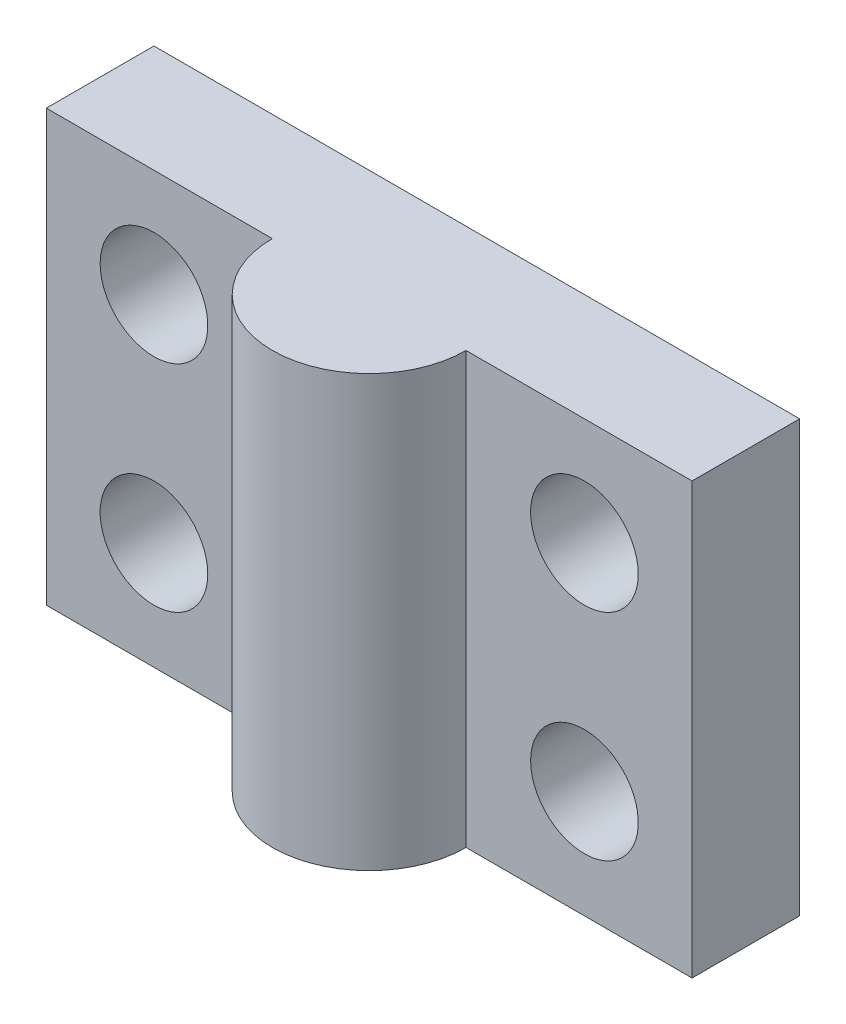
from build123d import *

# Parameters (mm, degrees)
SKETCH1_W           = 30
SKETCH1_H           = 20
SKETCH1_R           = 2.5
BOSS_EXTRUDE1_DEPTH = 5
BOSS_EXTRUDE2_DEPTH = 20


with BuildPart() as part:
    # Sketch1 → Boss-Extrude1 (new body)
    with BuildSketch(Plane.XY):
        Rectangle(SKETCH1_W, SKETCH1_H)
        with Locations((10, 5)):
            Circle(SKETCH1_R, mode=Mode.SUBTRACT)
        with Locations(Location((10, -5, 0), (0, 0, 180))):
            Circle(SKETCH1_R, mode=Mode.SUBTRACT)
        with Locations((-10, -5)):
            Circle(SKETCH1_R, mode=Mode.SUBTRACT)
        with Locations(Location((-10, 5, 0), (0, 0, 180))):
            Circle(SKETCH1_R, mode=Mode.SUBTRACT)
    extrude(amount=BOSS_EXTRUDE1_DEPTH)

    # Sketch2 → Boss-Extrude2 (add)
    with BuildSketch(Plane(origin=(0, 10, 0), x_dir=(1, 0, 0), z_dir=(0, 1, 0))):
        with BuildLine():
            Line((-4.5, -5), (4.5, -5))
            ThreePointArc((4.5, -5), (0, -9.5), (-4.5, -5))
        make_face()
    extrude(amount=-BOSS_EXTRUDE2_DEPTH)


solid = part.part
